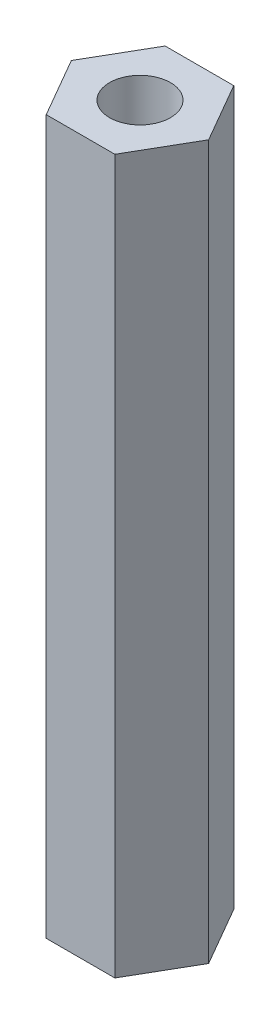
from build123d import *

# Parameters (mm, degrees)
SKETCH1_R           = 1.6256
BOSS_EXTRUDE1_DEPTH = 38.1


with BuildPart() as part:
    # Sketch1 → Boss-Extrude1 (new body)
    with BuildSketch(Plane(origin=(0, 0, 0), x_dir=(1, 0, 0), z_dir=(0, 1, 0))):
        Polygon((1.833087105, 3.175), (-1.833087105, 3.175), (-3.666174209, 0), (-1.833087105, -3.175), (1.833087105, -3.175), (3.666174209, 0), align=None)
        with Locations(Location((0, 0, 0), (0, 0, 90))):
            Circle(SKETCH1_R, mode=Mode.SUBTRACT)
    extrude(amount=BOSS_EXTRUDE1_DEPTH)


solid = part.part
